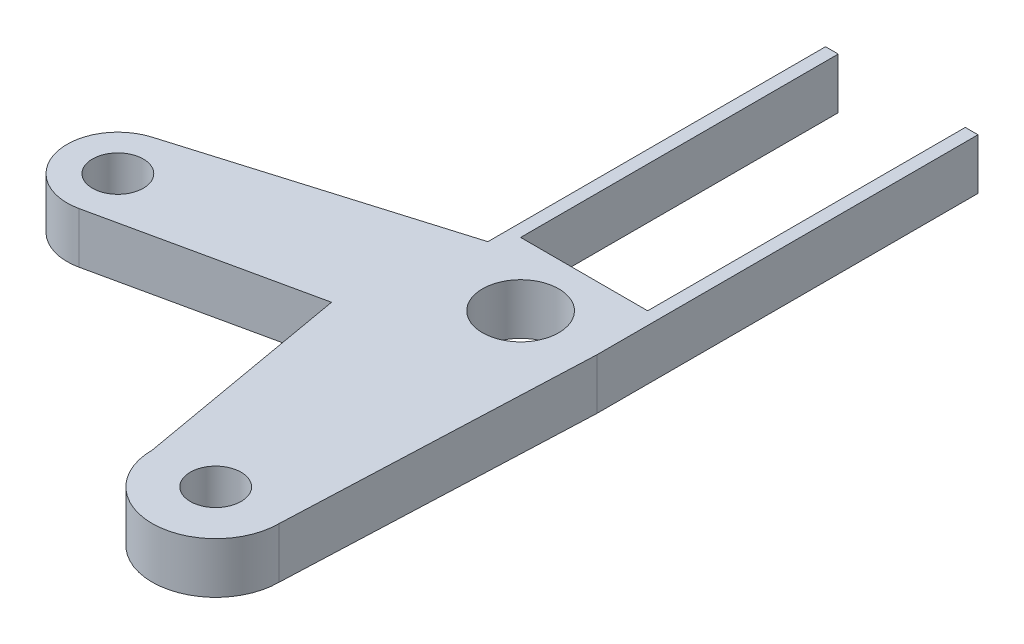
ISO-10303-21;
HEADER;
FILE_DESCRIPTION(('STEP AP214'),'2;1');
FILE_NAME('part.step','',(''),(''),'','','');
FILE_SCHEMA(('AUTOMOTIVE_DESIGN { 1 0 10303 214 1 1 1 1 }'));
ENDSEC;
DATA;
#1=APPLICATION_CONTEXT('core data for automotive mechanical design processes');
#2=APPLICATION_PROTOCOL_DEFINITION('international standard','automotive_design',2000,#1);
#3=PRODUCT_CONTEXT('',#1,'mechanical');
#4=PRODUCT('Part','Part','',(#3));
#5=PRODUCT_RELATED_PRODUCT_CATEGORY('part','',(#4));
#6=PRODUCT_DEFINITION_FORMATION('','',#4);
#7=PRODUCT_DEFINITION_CONTEXT('part definition',#1,'design');
#8=PRODUCT_DEFINITION('design','',#6,#7);
#9=PRODUCT_DEFINITION_SHAPE('','',#8);
#10=(LENGTH_UNIT() NAMED_UNIT(*) SI_UNIT(.MILLI.,.METRE.));
#11=(NAMED_UNIT(*) PLANE_ANGLE_UNIT() SI_UNIT($,.RADIAN.));
#12=(NAMED_UNIT(*) SI_UNIT($,.STERADIAN.) SOLID_ANGLE_UNIT());
#13=UNCERTAINTY_MEASURE_WITH_UNIT(LENGTH_MEASURE(1.E-05),#10,'distance_accuracy_value','');
#14=(GEOMETRIC_REPRESENTATION_CONTEXT(3) GLOBAL_UNCERTAINTY_ASSIGNED_CONTEXT((#13)) GLOBAL_UNIT_ASSIGNED_CONTEXT((#10,
#11,#12)) REPRESENTATION_CONTEXT('',''));
#15=CARTESIAN_POINT('',(0.,0.,0.));
#16=DIRECTION('',(0.,0.,1.));
#17=DIRECTION('',(1.,0.,0.));
#18=AXIS2_PLACEMENT_3D('',#15,#16,#17);
#19=CARTESIAN_POINT('',(-126.,380.,372.5));
#20=DIRECTION('',(0.,1.,0.));
#21=DIRECTION('',(0.,0.,1.));
#22=AXIS2_PLACEMENT_3D('',#19,#20,#21);
#23=PLANE('',#22);
#24=CARTESIAN_POINT('',(-126.,380.,372.5));
#25=DIRECTION('',(0.,1.,0.));
#26=DIRECTION('',(0.,0.,1.));
#27=AXIS2_PLACEMENT_3D('',#24,#25,#26);
#28=CIRCLE('',#27,10.);
#29=CARTESIAN_POINT('',(-126.,380.,382.5));
#30=VERTEX_POINT('',#29);
#31=EDGE_CURVE('E555',#30,#30,#28,.T.);
#32=ORIENTED_EDGE('',*,*,#31,.F.);
#33=EDGE_LOOP('',(#32));
#34=FACE_BOUND('',#33,.T.);
#35=CARTESIAN_POINT('',(-126.,380.,372.5));
#36=DIRECTION('',(0.,1.,0.));
#37=DIRECTION('',(0.,0.,1.));
#38=AXIS2_PLACEMENT_3D('',#35,#36,#37);
#39=CIRCLE('',#38,19.9999999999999);
#40=CARTESIAN_POINT('',(-131.735689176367,380.,353.340097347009));
#41=VERTEX_POINT('',#40);
#42=CARTESIAN_POINT('',(-121.752595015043,380.,392.043785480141));
#43=VERTEX_POINT('',#42);
#44=EDGE_CURVE('E326',#41,#43,#39,.T.);
#45=ORIENTED_EDGE('',*,*,#44,.T.);
#46=DIRECTION('',(0.97718927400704,0.,-0.212370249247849));
#47=VECTOR('',#46,1.);
#48=CARTESIAN_POINT('',(-121.752595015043,380.,392.043785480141));
#49=LINE('',#48,#47);
#50=CARTESIAN_POINT('',(-40.1110765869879,380.,374.300826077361));
#51=VERTEX_POINT('',#50);
#52=EDGE_CURVE('E232',#43,#51,#49,.T.);
#53=ORIENTED_EDGE('',*,*,#52,.T.);
#54=DIRECTION('',(-0.173648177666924,0.,-0.984807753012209));
#55=VECTOR('',#54,1.);
#56=CARTESIAN_POINT('',(-25.,380.,460.));
#57=LINE('',#56,#55);
#58=CARTESIAN_POINT('',(-24.9999999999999,380.,460.));
#59=VERTEX_POINT('',#58);
#60=EDGE_CURVE('E348',#59,#51,#57,.T.);
#61=ORIENTED_EDGE('',*,*,#60,.F.);
#62=CARTESIAN_POINT('',(0.,380.,460.));
#63=DIRECTION('',(0.,1.,0.));
#64=DIRECTION('',(0.,0.,1.));
#65=AXIS2_PLACEMENT_3D('',#62,#63,#64);
#66=CIRCLE('',#65,25.);
#67=CARTESIAN_POINT('',(25.,380.,460.));
#68=VERTEX_POINT('',#67);
#69=EDGE_CURVE('E361',#59,#68,#66,.T.);
#70=ORIENTED_EDGE('',*,*,#69,.T.);
#71=DIRECTION('',(-0.0416305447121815,0.,0.999133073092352));
#72=VECTOR('',#71,1.);
#73=CARTESIAN_POINT('',(30.,380.,340.));
#74=LINE('',#73,#72);
#75=CARTESIAN_POINT('',(30.,380.,340.));
#76=VERTEX_POINT('',#75);
#77=EDGE_CURVE('E363',#76,#68,#74,.T.);
#78=ORIENTED_EDGE('',*,*,#77,.F.);
#79=DIRECTION('',(0.,0.,1.));
#80=VECTOR('',#79,1.);
#81=CARTESIAN_POINT('',(30.,380.,190.));
#82=LINE('',#81,#80);
#83=CARTESIAN_POINT('',(30.,380.,190.));
#84=VERTEX_POINT('',#83);
#85=EDGE_CURVE('E370',#84,#76,#82,.T.);
#86=ORIENTED_EDGE('',*,*,#85,.F.);
#87=DIRECTION('',(1.,0.,0.));
#88=VECTOR('',#87,1.);
#89=CARTESIAN_POINT('',(25.,380.,190.));
#90=LINE('',#89,#88);
#91=CARTESIAN_POINT('',(25.,380.,190.));
#92=VERTEX_POINT('',#91);
#93=EDGE_CURVE('E373',#92,#84,#90,.T.);
#94=ORIENTED_EDGE('',*,*,#93,.F.);
#95=DIRECTION('',(0.,0.,1.));
#96=VECTOR('',#95,1.);
#97=CARTESIAN_POINT('',(25.,380.,190.));
#98=LINE('',#97,#96);
#99=CARTESIAN_POINT('',(25.,380.,315.));
#100=VERTEX_POINT('',#99);
#101=EDGE_CURVE('E376',#92,#100,#98,.T.);
#102=ORIENTED_EDGE('',*,*,#101,.T.);
#103=DIRECTION('',(1.,0.,0.));
#104=VECTOR('',#103,1.);
#105=CARTESIAN_POINT('',(-25.,380.,315.));
#106=LINE('',#105,#104);
#107=CARTESIAN_POINT('',(-25.,380.,315.));
#108=VERTEX_POINT('',#107);
#109=EDGE_CURVE('E378',#108,#100,#106,.T.);
#110=ORIENTED_EDGE('',*,*,#109,.F.);
#111=DIRECTION('',(0.,0.,-1.));
#112=VECTOR('',#111,1.);
#113=CARTESIAN_POINT('',(-25.,380.,315.));
#114=LINE('',#113,#112);
#115=CARTESIAN_POINT('',(-25.,380.,190.));
#116=VERTEX_POINT('',#115);
#117=EDGE_CURVE('E281',#108,#116,#114,.T.);
#118=ORIENTED_EDGE('',*,*,#117,.T.);
#119=DIRECTION('',(1.,0.,0.));
#120=VECTOR('',#119,1.);
#121=CARTESIAN_POINT('',(-30.,380.,190.));
#122=LINE('',#121,#120);
#123=CARTESIAN_POINT('',(-30.,380.,190.));
#124=VERTEX_POINT('',#123);
#125=EDGE_CURVE('E266',#124,#116,#122,.T.);
#126=ORIENTED_EDGE('',*,*,#125,.F.);
#127=DIRECTION('',(0.,0.,-1.));
#128=VECTOR('',#127,1.);
#129=CARTESIAN_POINT('',(-30.,380.,322.884603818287));
#130=LINE('',#129,#128);
#131=CARTESIAN_POINT('',(-30.,380.,322.884603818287));
#132=VERTEX_POINT('',#131);
#133=EDGE_CURVE('E278',#132,#124,#130,.T.);
#134=ORIENTED_EDGE('',*,*,#133,.F.);
#135=DIRECTION('',(0.957995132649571,0.,-0.286784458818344));
#136=VECTOR('',#135,1.);
#137=CARTESIAN_POINT('',(-131.735689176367,380.,353.340097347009));
#138=LINE('',#137,#136);
#139=EDGE_CURVE('E285',#41,#132,#138,.T.);
#140=ORIENTED_EDGE('',*,*,#139,.F.);
#141=EDGE_LOOP('',(#45,#53,#61,#70,#78,#86,#94,#102,#110,#118,#126,#134,#140));
#142=FACE_BOUND('',#141,.T.);
#143=CARTESIAN_POINT('',(0.,380.,340.));
#144=DIRECTION('',(0.,1.,0.));
#145=DIRECTION('',(0.,0.,1.));
#146=AXIS2_PLACEMENT_3D('',#143,#144,#145);
#147=CIRCLE('',#146,15.);
#148=CARTESIAN_POINT('',(0.,380.,355.));
#149=VERTEX_POINT('',#148);
#150=EDGE_CURVE('E293',#149,#149,#147,.T.);
#151=ORIENTED_EDGE('',*,*,#150,.F.);
#152=EDGE_LOOP('',(#151));
#153=FACE_BOUND('',#152,.T.);
#154=CARTESIAN_POINT('',(0.,380.,460.));
#155=DIRECTION('',(0.,1.,0.));
#156=DIRECTION('',(0.,0.,1.));
#157=AXIS2_PLACEMENT_3D('',#154,#155,#156);
#158=CIRCLE('',#157,10.);
#159=CARTESIAN_POINT('',(0.,380.,470.));
#160=VERTEX_POINT('',#159);
#161=EDGE_CURVE('E561',#160,#160,#158,.T.);
#162=ORIENTED_EDGE('',*,*,#161,.F.);
#163=EDGE_LOOP('',(#162));
#164=FACE_BOUND('',#163,.T.);
#165=ADVANCED_FACE('F162',(#34,#142,#153,#164),#23,.T.);
#166=CARTESIAN_POINT('',(-126.,360.,372.5));
#167=DIRECTION('',(0.,1.,0.));
#168=DIRECTION('',(0.,0.,1.));
#169=AXIS2_PLACEMENT_3D('',#166,#167,#168);
#170=PLANE('',#169);
#171=CARTESIAN_POINT('',(-126.,360.,372.5));
#172=DIRECTION('',(0.,1.,0.));
#173=DIRECTION('',(0.,0.,1.));
#174=AXIS2_PLACEMENT_3D('',#171,#172,#173);
#175=CIRCLE('',#174,19.9999999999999);
#176=CARTESIAN_POINT('',(-131.735689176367,360.,353.340097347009));
#177=VERTEX_POINT('',#176);
#178=CARTESIAN_POINT('',(-121.752595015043,360.,392.043785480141));
#179=VERTEX_POINT('',#178);
#180=EDGE_CURVE('E290',#177,#179,#175,.T.);
#181=ORIENTED_EDGE('',*,*,#180,.F.);
#182=DIRECTION('',(0.957995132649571,0.,-0.286784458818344));
#183=VECTOR('',#182,1.);
#184=CARTESIAN_POINT('',(-131.735689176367,360.,353.340097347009));
#185=LINE('',#184,#183);
#186=CARTESIAN_POINT('',(-30.,360.,322.884603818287));
#187=VERTEX_POINT('',#186);
#188=EDGE_CURVE('E323',#177,#187,#185,.T.);
#189=ORIENTED_EDGE('',*,*,#188,.T.);
#190=DIRECTION('',(0.,0.,-1.));
#191=VECTOR('',#190,1.);
#192=CARTESIAN_POINT('',(-30.,360.,322.884603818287));
#193=LINE('',#192,#191);
#194=CARTESIAN_POINT('',(-30.,360.,190.));
#195=VERTEX_POINT('',#194);
#196=EDGE_CURVE('E321',#187,#195,#193,.T.);
#197=ORIENTED_EDGE('',*,*,#196,.T.);
#198=DIRECTION('',(1.,0.,0.));
#199=VECTOR('',#198,1.);
#200=CARTESIAN_POINT('',(-30.,360.,190.));
#201=LINE('',#200,#199);
#202=CARTESIAN_POINT('',(-25.,360.,190.));
#203=VERTEX_POINT('',#202);
#204=EDGE_CURVE('E268',#195,#203,#201,.T.);
#205=ORIENTED_EDGE('',*,*,#204,.T.);
#206=DIRECTION('',(0.,0.,-1.));
#207=VECTOR('',#206,1.);
#208=CARTESIAN_POINT('',(-25.,360.,315.));
#209=LINE('',#208,#207);
#210=CARTESIAN_POINT('',(-25.,360.,315.));
#211=VERTEX_POINT('',#210);
#212=EDGE_CURVE('E317',#211,#203,#209,.T.);
#213=ORIENTED_EDGE('',*,*,#212,.F.);
#214=DIRECTION('',(1.,0.,0.));
#215=VECTOR('',#214,1.);
#216=CARTESIAN_POINT('',(-25.,360.,315.));
#217=LINE('',#216,#215);
#218=CARTESIAN_POINT('',(25.,360.,315.));
#219=VERTEX_POINT('',#218);
#220=EDGE_CURVE('E314',#211,#219,#217,.T.);
#221=ORIENTED_EDGE('',*,*,#220,.T.);
#222=DIRECTION('',(0.,0.,1.));
#223=VECTOR('',#222,1.);
#224=CARTESIAN_POINT('',(25.,360.,190.));
#225=LINE('',#224,#223);
#226=CARTESIAN_POINT('',(25.,360.,190.));
#227=VERTEX_POINT('',#226);
#228=EDGE_CURVE('E311',#227,#219,#225,.T.);
#229=ORIENTED_EDGE('',*,*,#228,.F.);
#230=DIRECTION('',(1.,0.,0.));
#231=VECTOR('',#230,1.);
#232=CARTESIAN_POINT('',(25.,360.,190.));
#233=LINE('',#232,#231);
#234=CARTESIAN_POINT('',(30.,360.,190.));
#235=VERTEX_POINT('',#234);
#236=EDGE_CURVE('E308',#227,#235,#233,.T.);
#237=ORIENTED_EDGE('',*,*,#236,.T.);
#238=DIRECTION('',(0.,0.,1.));
#239=VECTOR('',#238,1.);
#240=CARTESIAN_POINT('',(30.,360.,190.));
#241=LINE('',#240,#239);
#242=CARTESIAN_POINT('',(30.,360.,340.));
#243=VERTEX_POINT('',#242);
#244=EDGE_CURVE('E305',#235,#243,#241,.T.);
#245=ORIENTED_EDGE('',*,*,#244,.T.);
#246=DIRECTION('',(-0.0416305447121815,0.,0.999133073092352));
#247=VECTOR('',#246,1.);
#248=CARTESIAN_POINT('',(30.,360.,340.));
#249=LINE('',#248,#247);
#250=CARTESIAN_POINT('',(25.,360.,460.));
#251=VERTEX_POINT('',#250);
#252=EDGE_CURVE('E302',#243,#251,#249,.T.);
#253=ORIENTED_EDGE('',*,*,#252,.T.);
#254=CARTESIAN_POINT('',(0.,360.,460.));
#255=DIRECTION('',(0.,1.,0.));
#256=DIRECTION('',(0.,0.,1.));
#257=AXIS2_PLACEMENT_3D('',#254,#255,#256);
#258=CIRCLE('',#257,25.);
#259=CARTESIAN_POINT('',(-24.9999999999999,360.,460.));
#260=VERTEX_POINT('',#259);
#261=EDGE_CURVE('E299',#260,#251,#258,.T.);
#262=ORIENTED_EDGE('',*,*,#261,.F.);
#263=DIRECTION('',(-0.173648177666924,0.,-0.984807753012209));
#264=VECTOR('',#263,1.);
#265=CARTESIAN_POINT('',(-25.,360.,460.));
#266=LINE('',#265,#264);
#267=CARTESIAN_POINT('',(-40.1110765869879,360.,374.300826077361));
#268=VERTEX_POINT('',#267);
#269=EDGE_CURVE('E296',#260,#268,#266,.T.);
#270=ORIENTED_EDGE('',*,*,#269,.T.);
#271=DIRECTION('',(0.97718927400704,0.,-0.212370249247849));
#272=VECTOR('',#271,1.);
#273=CARTESIAN_POINT('',(-121.752595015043,360.,392.043785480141));
#274=LINE('',#273,#272);
#275=EDGE_CURVE('E292',#179,#268,#274,.T.);
#276=ORIENTED_EDGE('',*,*,#275,.F.);
#277=EDGE_LOOP('',(#181,#189,#197,#205,#213,#221,#229,#237,#245,#253,#262,#270,#276));
#278=FACE_BOUND('',#277,.T.);
#279=CARTESIAN_POINT('',(0.,360.,340.));
#280=DIRECTION('',(0.,1.,0.));
#281=DIRECTION('',(0.,0.,1.));
#282=AXIS2_PLACEMENT_3D('',#279,#280,#281);
#283=CIRCLE('',#282,15.);
#284=CARTESIAN_POINT('',(0.,360.,355.));
#285=VERTEX_POINT('',#284);
#286=EDGE_CURVE('E552',#285,#285,#283,.T.);
#287=ORIENTED_EDGE('',*,*,#286,.T.);
#288=EDGE_LOOP('',(#287));
#289=FACE_BOUND('',#288,.T.);
#290=CARTESIAN_POINT('',(-126.,360.,372.5));
#291=DIRECTION('',(0.,1.,0.));
#292=DIRECTION('',(0.,0.,1.));
#293=AXIS2_PLACEMENT_3D('',#290,#291,#292);
#294=CIRCLE('',#293,10.);
#295=CARTESIAN_POINT('',(-126.,360.,382.5));
#296=VERTEX_POINT('',#295);
#297=EDGE_CURVE('E558',#296,#296,#294,.T.);
#298=ORIENTED_EDGE('',*,*,#297,.T.);
#299=EDGE_LOOP('',(#298));
#300=FACE_BOUND('',#299,.T.);
#301=CARTESIAN_POINT('',(0.,360.,460.));
#302=DIRECTION('',(0.,1.,0.));
#303=DIRECTION('',(0.,0.,1.));
#304=AXIS2_PLACEMENT_3D('',#301,#302,#303);
#305=CIRCLE('',#304,10.);
#306=CARTESIAN_POINT('',(0.,360.,470.));
#307=VERTEX_POINT('',#306);
#308=EDGE_CURVE('E564',#307,#307,#305,.T.);
#309=ORIENTED_EDGE('',*,*,#308,.T.);
#310=EDGE_LOOP('',(#309));
#311=FACE_BOUND('',#310,.T.);
#312=ADVANCED_FACE('F353',(#278,#289,#300,#311),#170,.F.);
#313=CARTESIAN_POINT('',(-126.,380.,372.5));
#314=DIRECTION('',(0.,-1.,0.));
#315=DIRECTION('',(0.,0.,-1.));
#316=AXIS2_PLACEMENT_3D('',#313,#314,#315);
#317=CYLINDRICAL_SURFACE('',#316,19.9999999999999);
#318=ORIENTED_EDGE('',*,*,#180,.T.);
#319=DIRECTION('',(0.,-1.,0.));
#320=VECTOR('',#319,1.);
#321=CARTESIAN_POINT('',(-121.752595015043,380.,392.043785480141));
#322=LINE('',#321,#320);
#323=EDGE_CURVE('E12',#43,#179,#322,.T.);
#324=ORIENTED_EDGE('',*,*,#323,.F.);
#325=ORIENTED_EDGE('',*,*,#44,.F.);
#326=DIRECTION('',(0.,-1.,0.));
#327=VECTOR('',#326,1.);
#328=CARTESIAN_POINT('',(-131.735689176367,380.,353.340097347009));
#329=LINE('',#328,#327);
#330=EDGE_CURVE('E179',#41,#177,#329,.T.);
#331=ORIENTED_EDGE('',*,*,#330,.T.);
#332=EDGE_LOOP('',(#318,#324,#325,#331));
#333=FACE_BOUND('',#332,.T.);
#334=ADVANCED_FACE('F164',(#333),#317,.T.);
#335=CARTESIAN_POINT('',(-121.752595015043,380.,392.043785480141));
#336=DIRECTION('',(-0.212370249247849,0.,-0.97718927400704));
#337=DIRECTION('',(-0.97718927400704,0.,0.212370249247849));
#338=AXIS2_PLACEMENT_3D('',#335,#336,#337);
#339=PLANE('',#338);
#340=ORIENTED_EDGE('',*,*,#275,.T.);
#341=DIRECTION('',(0.,-1.,0.));
#342=VECTOR('',#341,1.);
#343=CARTESIAN_POINT('',(-40.1110765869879,380.,374.300826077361));
#344=LINE('',#343,#342);
#345=EDGE_CURVE('E171',#51,#268,#344,.T.);
#346=ORIENTED_EDGE('',*,*,#345,.F.);
#347=ORIENTED_EDGE('',*,*,#52,.F.);
#348=ORIENTED_EDGE('',*,*,#323,.T.);
#349=EDGE_LOOP('',(#340,#346,#347,#348));
#350=FACE_BOUND('',#349,.T.);
#351=ADVANCED_FACE('F349',(#350),#339,.F.);
#352=CARTESIAN_POINT('',(-25.,380.,460.));
#353=DIRECTION('',(-0.984807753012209,0.,0.173648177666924));
#354=DIRECTION('',(0.173648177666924,0.,0.984807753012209));
#355=AXIS2_PLACEMENT_3D('',#352,#353,#354);
#356=PLANE('',#355);
#357=ORIENTED_EDGE('',*,*,#269,.F.);
#358=DIRECTION('',(0.,-1.,0.));
#359=VECTOR('',#358,1.);
#360=CARTESIAN_POINT('',(-24.9999999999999,380.,460.));
#361=LINE('',#360,#359);
#362=EDGE_CURVE('E342',#59,#260,#361,.T.);
#363=ORIENTED_EDGE('',*,*,#362,.F.);
#364=ORIENTED_EDGE('',*,*,#60,.T.);
#365=ORIENTED_EDGE('',*,*,#345,.T.);
#366=EDGE_LOOP('',(#357,#363,#364,#365));
#367=FACE_BOUND('',#366,.T.);
#368=ADVANCED_FACE('F346',(#367),#356,.T.);
#369=CARTESIAN_POINT('',(0.,380.,460.));
#370=DIRECTION('',(0.,-1.,0.));
#371=DIRECTION('',(0.,0.,-1.));
#372=AXIS2_PLACEMENT_3D('',#369,#370,#371);
#373=CYLINDRICAL_SURFACE('',#372,25.);
#374=ORIENTED_EDGE('',*,*,#261,.T.);
#375=DIRECTION('',(0.,-1.,0.));
#376=VECTOR('',#375,1.);
#377=CARTESIAN_POINT('',(25.,380.,460.));
#378=LINE('',#377,#376);
#379=EDGE_CURVE('E340',#68,#251,#378,.T.);
#380=ORIENTED_EDGE('',*,*,#379,.F.);
#381=ORIENTED_EDGE('',*,*,#69,.F.);
#382=ORIENTED_EDGE('',*,*,#362,.T.);
#383=EDGE_LOOP('',(#374,#380,#381,#382));
#384=FACE_BOUND('',#383,.T.);
#385=ADVANCED_FACE('F358',(#384),#373,.T.);
#386=CARTESIAN_POINT('',(30.,380.,340.));
#387=DIRECTION('',(0.999133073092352,0.,0.0416305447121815));
#388=DIRECTION('',(0.0416305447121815,0.,-0.999133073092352));
#389=AXIS2_PLACEMENT_3D('',#386,#387,#388);
#390=PLANE('',#389);
#391=ORIENTED_EDGE('',*,*,#252,.F.);
#392=DIRECTION('',(0.,-1.,0.));
#393=VECTOR('',#392,1.);
#394=CARTESIAN_POINT('',(30.,380.,340.));
#395=LINE('',#394,#393);
#396=EDGE_CURVE('E338',#76,#243,#395,.T.);
#397=ORIENTED_EDGE('',*,*,#396,.F.);
#398=ORIENTED_EDGE('',*,*,#77,.T.);
#399=ORIENTED_EDGE('',*,*,#379,.T.);
#400=EDGE_LOOP('',(#391,#397,#398,#399));
#401=FACE_BOUND('',#400,.T.);
#402=ADVANCED_FACE('F495',(#401),#390,.T.);
#403=CARTESIAN_POINT('',(30.,380.,190.));
#404=DIRECTION('',(1.,0.,0.));
#405=DIRECTION('',(0.,0.,-1.));
#406=AXIS2_PLACEMENT_3D('',#403,#404,#405);
#407=PLANE('',#406);
#408=ORIENTED_EDGE('',*,*,#244,.F.);
#409=DIRECTION('',(0.,-1.,0.));
#410=VECTOR('',#409,1.);
#411=CARTESIAN_POINT('',(30.,380.,190.));
#412=LINE('',#411,#410);
#413=EDGE_CURVE('E336',#84,#235,#412,.T.);
#414=ORIENTED_EDGE('',*,*,#413,.F.);
#415=ORIENTED_EDGE('',*,*,#85,.T.);
#416=ORIENTED_EDGE('',*,*,#396,.T.);
#417=EDGE_LOOP('',(#408,#414,#415,#416));
#418=FACE_BOUND('',#417,.T.);
#419=ADVANCED_FACE('F486',(#418),#407,.T.);
#420=CARTESIAN_POINT('',(25.,380.,190.));
#421=DIRECTION('',(0.,0.,-1.));
#422=DIRECTION('',(-1.,0.,0.));
#423=AXIS2_PLACEMENT_3D('',#420,#421,#422);
#424=PLANE('',#423);
#425=ORIENTED_EDGE('',*,*,#236,.F.);
#426=DIRECTION('',(0.,-1.,0.));
#427=VECTOR('',#426,1.);
#428=CARTESIAN_POINT('',(25.,380.,190.));
#429=LINE('',#428,#427);
#430=EDGE_CURVE('E334',#92,#227,#429,.T.);
#431=ORIENTED_EDGE('',*,*,#430,.F.);
#432=ORIENTED_EDGE('',*,*,#93,.T.);
#433=ORIENTED_EDGE('',*,*,#413,.T.);
#434=EDGE_LOOP('',(#425,#431,#432,#433));
#435=FACE_BOUND('',#434,.T.);
#436=ADVANCED_FACE('F478',(#435),#424,.T.);
#437=CARTESIAN_POINT('',(25.,380.,190.));
#438=DIRECTION('',(1.,0.,0.));
#439=DIRECTION('',(0.,0.,-1.));
#440=AXIS2_PLACEMENT_3D('',#437,#438,#439);
#441=PLANE('',#440);
#442=ORIENTED_EDGE('',*,*,#228,.T.);
#443=DIRECTION('',(0.,-1.,0.));
#444=VECTOR('',#443,1.);
#445=CARTESIAN_POINT('',(25.,380.,315.));
#446=LINE('',#445,#444);
#447=EDGE_CURVE('E332',#100,#219,#446,.T.);
#448=ORIENTED_EDGE('',*,*,#447,.F.);
#449=ORIENTED_EDGE('',*,*,#101,.F.);
#450=ORIENTED_EDGE('',*,*,#430,.T.);
#451=EDGE_LOOP('',(#442,#448,#449,#450));
#452=FACE_BOUND('',#451,.T.);
#453=ADVANCED_FACE('F388',(#452),#441,.F.);
#454=CARTESIAN_POINT('',(-25.,380.,315.));
#455=DIRECTION('',(0.,0.,-1.));
#456=DIRECTION('',(-1.,0.,0.));
#457=AXIS2_PLACEMENT_3D('',#454,#455,#456);
#458=PLANE('',#457);
#459=ORIENTED_EDGE('',*,*,#220,.F.);
#460=DIRECTION('',(0.,-1.,0.));
#461=VECTOR('',#460,1.);
#462=CARTESIAN_POINT('',(-25.,380.,315.));
#463=LINE('',#462,#461);
#464=EDGE_CURVE('E330',#108,#211,#463,.T.);
#465=ORIENTED_EDGE('',*,*,#464,.F.);
#466=ORIENTED_EDGE('',*,*,#109,.T.);
#467=ORIENTED_EDGE('',*,*,#447,.T.);
#468=EDGE_LOOP('',(#459,#465,#466,#467));
#469=FACE_BOUND('',#468,.T.);
#470=ADVANCED_FACE('F382',(#469),#458,.T.);
#471=CARTESIAN_POINT('',(-25.,380.,315.));
#472=DIRECTION('',(-1.,0.,0.));
#473=DIRECTION('',(0.,0.,1.));
#474=AXIS2_PLACEMENT_3D('',#471,#472,#473);
#475=PLANE('',#474);
#476=ORIENTED_EDGE('',*,*,#212,.T.);
#477=DIRECTION('',(0.,-1.,0.));
#478=VECTOR('',#477,1.);
#479=CARTESIAN_POINT('',(-25.,380.,190.));
#480=LINE('',#479,#478);
#481=EDGE_CURVE('E272',#116,#203,#480,.T.);
#482=ORIENTED_EDGE('',*,*,#481,.F.);
#483=ORIENTED_EDGE('',*,*,#117,.F.);
#484=ORIENTED_EDGE('',*,*,#464,.T.);
#485=EDGE_LOOP('',(#476,#482,#483,#484));
#486=FACE_BOUND('',#485,.T.);
#487=ADVANCED_FACE('F393',(#486),#475,.F.);
#488=CARTESIAN_POINT('',(-30.,380.,190.));
#489=DIRECTION('',(0.,0.,-1.));
#490=DIRECTION('',(-1.,0.,0.));
#491=AXIS2_PLACEMENT_3D('',#488,#489,#490);
#492=PLANE('',#491);
#493=ORIENTED_EDGE('',*,*,#204,.F.);
#494=DIRECTION('',(0.,-1.,0.));
#495=VECTOR('',#494,1.);
#496=CARTESIAN_POINT('',(-30.,380.,190.));
#497=LINE('',#496,#495);
#498=EDGE_CURVE('E263',#124,#195,#497,.T.);
#499=ORIENTED_EDGE('',*,*,#498,.F.);
#500=ORIENTED_EDGE('',*,*,#125,.T.);
#501=ORIENTED_EDGE('',*,*,#481,.T.);
#502=EDGE_LOOP('',(#493,#499,#500,#501));
#503=FACE_BOUND('',#502,.T.);
#504=ADVANCED_FACE('F265',(#503),#492,.T.);
#505=CARTESIAN_POINT('',(-30.,380.,322.884603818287));
#506=DIRECTION('',(-1.,0.,0.));
#507=DIRECTION('',(0.,0.,1.));
#508=AXIS2_PLACEMENT_3D('',#505,#506,#507);
#509=PLANE('',#508);
#510=ORIENTED_EDGE('',*,*,#196,.F.);
#511=DIRECTION('',(0.,-1.,0.));
#512=VECTOR('',#511,1.);
#513=CARTESIAN_POINT('',(-30.,380.,322.884603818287));
#514=LINE('',#513,#512);
#515=EDGE_CURVE('E220',#132,#187,#514,.T.);
#516=ORIENTED_EDGE('',*,*,#515,.F.);
#517=ORIENTED_EDGE('',*,*,#133,.T.);
#518=ORIENTED_EDGE('',*,*,#498,.T.);
#519=EDGE_LOOP('',(#510,#516,#517,#518));
#520=FACE_BOUND('',#519,.T.);
#521=ADVANCED_FACE('F284',(#520),#509,.T.);
#522=CARTESIAN_POINT('',(-131.735689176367,380.,353.340097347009));
#523=DIRECTION('',(-0.286784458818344,0.,-0.957995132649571));
#524=DIRECTION('',(-0.957995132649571,0.,0.286784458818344));
#525=AXIS2_PLACEMENT_3D('',#522,#523,#524);
#526=PLANE('',#525);
#527=ORIENTED_EDGE('',*,*,#188,.F.);
#528=ORIENTED_EDGE('',*,*,#330,.F.);
#529=ORIENTED_EDGE('',*,*,#139,.T.);
#530=ORIENTED_EDGE('',*,*,#515,.T.);
#531=EDGE_LOOP('',(#527,#528,#529,#530));
#532=FACE_BOUND('',#531,.T.);
#533=ADVANCED_FACE('F414',(#532),#526,.T.);
#534=CARTESIAN_POINT('',(0.,380.,340.));
#535=DIRECTION('',(0.,-1.,0.));
#536=DIRECTION('',(0.,0.,-1.));
#537=AXIS2_PLACEMENT_3D('',#534,#535,#536);
#538=CYLINDRICAL_SURFACE('',#537,15.);
#539=ORIENTED_EDGE('',*,*,#150,.T.);
#540=EDGE_LOOP('',(#539));
#541=FACE_BOUND('',#540,.T.);
#542=ORIENTED_EDGE('',*,*,#286,.F.);
#543=EDGE_LOOP('',(#542));
#544=FACE_BOUND('',#543,.T.);
#545=ADVANCED_FACE('F411',(#541,#544),#538,.F.);
#546=CARTESIAN_POINT('',(-126.,380.,372.5));
#547=DIRECTION('',(0.,-1.,0.));
#548=DIRECTION('',(0.,0.,-1.));
#549=AXIS2_PLACEMENT_3D('',#546,#547,#548);
#550=CYLINDRICAL_SURFACE('',#549,10.);
#551=ORIENTED_EDGE('',*,*,#31,.T.);
#552=EDGE_LOOP('',(#551));
#553=FACE_BOUND('',#552,.T.);
#554=ORIENTED_EDGE('',*,*,#297,.F.);
#555=EDGE_LOOP('',(#554));
#556=FACE_BOUND('',#555,.T.);
#557=ADVANCED_FACE('F432',(#553,#556),#550,.F.);
#558=CARTESIAN_POINT('',(0.,380.,460.));
#559=DIRECTION('',(0.,-1.,0.));
#560=DIRECTION('',(0.,0.,-1.));
#561=AXIS2_PLACEMENT_3D('',#558,#559,#560);
#562=CYLINDRICAL_SURFACE('',#561,10.);
#563=ORIENTED_EDGE('',*,*,#161,.T.);
#564=EDGE_LOOP('',(#563));
#565=FACE_BOUND('',#564,.T.);
#566=ORIENTED_EDGE('',*,*,#308,.F.);
#567=EDGE_LOOP('',(#566));
#568=FACE_BOUND('',#567,.T.);
#569=ADVANCED_FACE('F439',(#565,#568),#562,.F.);
#570=CLOSED_SHELL('',(#165,#312,#334,#351,#368,#385,#402,#419,#436,#453,#470,#487,#504,#521,
#533,#545,#557,#569));
#571=MANIFOLD_SOLID_BREP('B2',#570);
#572=ADVANCED_BREP_SHAPE_REPRESENTATION('',(#18,#571),#14);
#573=SHAPE_DEFINITION_REPRESENTATION(#9,#572);
ENDSEC;
END-ISO-10303-21;
